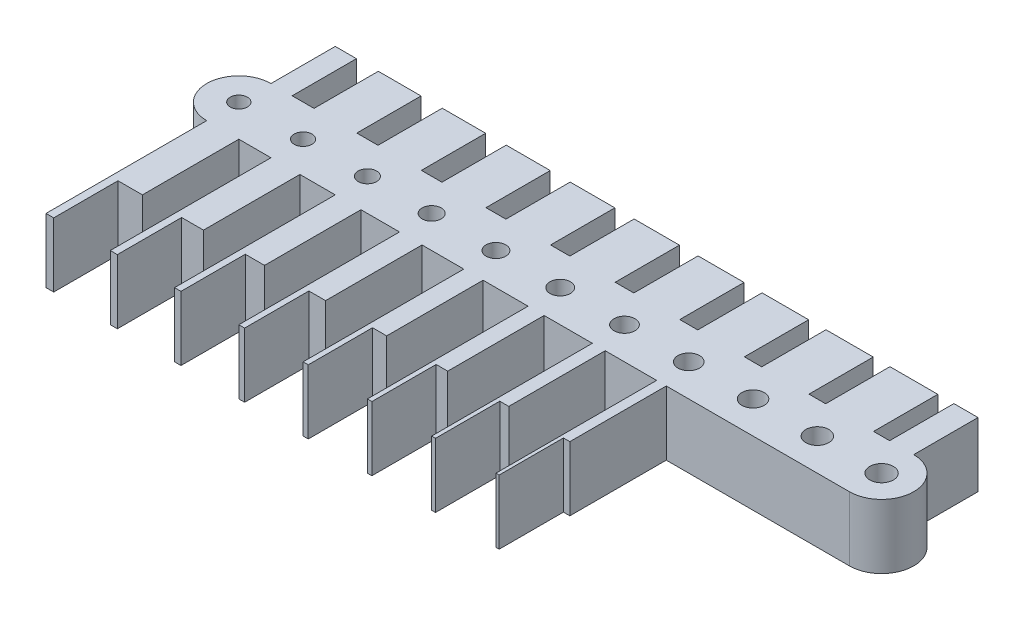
from build123d import *

# Parameters (mm, degrees)
SKETCH1_R              = 1.5875
SKETCH1_R_2            = 1.6375
SKETCH1_R_3            = 1.6875
SKETCH1_R_4            = 1.7375
SKETCH1_R_5            = 1.7875
SKETCH1_R_6            = 1.5375
SKETCH1_R_7            = 1.4875
SKETCH1_R_8            = 1.4375
SKETCH1_R_9            = 1.3875
SKETCH1_R_10           = 1.8375
SKETCH1_R_11           = 1.3375
PIN_DEPTH              = 10
SKETCH2_W              = 5
SKETCH2_H              = 15
SKETCH2_W_2            = 4
SKETCH2_W_3            = 3
SKETCH2_W_4            = 2
SKETCH2_W_5            = 4.5
SKETCH2_W_6            = 3.5
SKETCH2_W_7            = 2.5
SKETCH2_W_8            = 1.5
WIDTH_KEEP_DEPTH       = 10
SKETCH3_W              = 1.2
SKETCH3_H              = 10
SKETCH3_W_2            = 1.1
SKETCH3_W_3            = 1
SKETCH3_W_4            = 0.9
SKETCH3_W_5            = 0.8
SKETCH3_W_6            = 0.7
SKETCH3_W_7            = 0.6
SKETCH3_W_8            = 0.5
WIDTH_DESTROY_DEPTH    = 10
SKETCH4_W              = 3.75
SKETCH4_H              = 10
SKETCH4_W_2            = 3.3
SKETCH4_W_3            = 7.45
SKETCH4_W_4            = 7.35
SKETCH4_W_5            = 7.25
SKETCH4_W_6            = 7.15
SKETCH4_W_7            = 7.05
SKETCH4_W_8            = 6.95
SKETCH4_W_9            = 6.85
SKETCH4_W_10           = 6.75
SKETCH4_W_11           = 6.65
PULLEY_THICKNESS_DEPTH = 10


with BuildPart() as part:
    # Sketch1 → Pin (new body)
    with BuildSketch(Plane(origin=(0, 0, 0), x_dir=(1, 0, 0), z_dir=(0, 1, 0))):
        with BuildLine():
            Line((0, 0), (100, 0))
            ThreePointArc((100, 0), (105, 5), (100, 10))
            Line((100, 10), (0, 10))
            ThreePointArc((0, 10), (-5, 5), (0, 0))
        make_face()
        with Locations(Location((50, 5, 0), (0, 0, 270))):
            Circle(SKETCH1_R, mode=Mode.SUBTRACT)
        with Locations(Location((60, 5, 0), (0, 0, 270))):
            Circle(SKETCH1_R_2, mode=Mode.SUBTRACT)
        with Locations(Location((70, 5, 0), (0, 0, 270))):
            Circle(SKETCH1_R_3, mode=Mode.SUBTRACT)
        with Locations(Location((80, 5, 0), (0, 0, 270))):
            Circle(SKETCH1_R_4, mode=Mode.SUBTRACT)
        with Locations(Location((90, 5, 0), (0, 0, 270))):
            Circle(SKETCH1_R_5, mode=Mode.SUBTRACT)
        with Locations(Location((40, 5, 0), (0, 0, 270))):
            Circle(SKETCH1_R_6, mode=Mode.SUBTRACT)
        with Locations(Location((30, 5, 0), (0, 0, 270))):
            Circle(SKETCH1_R_7, mode=Mode.SUBTRACT)
        with Locations(Location((20, 5, 0), (0, 0, 270))):
            Circle(SKETCH1_R_8, mode=Mode.SUBTRACT)
        with Locations(Location((10, 5, 0), (0, 0, 270))):
            Circle(SKETCH1_R_9, mode=Mode.SUBTRACT)
        with Locations(Location((100, 5, 0), (0, 0, 270))):
            Circle(SKETCH1_R_10, mode=Mode.SUBTRACT)
        with Locations(Location((0, 5, 0), (0, 0, 270))):
            Circle(SKETCH1_R_11, mode=Mode.SUBTRACT)
    extrude(amount=PIN_DEPTH)

    # Sketch2 → Width Keep (add)
    with BuildSketch(Plane(origin=(0, 10, 0), x_dir=(1, 0, 0), z_dir=(0, 1, 0))):
        with Locations((2.5, -7.5)):
            Rectangle(SKETCH2_W, SKETCH2_H)
        with Locations((22, -7.5)):
            Rectangle(SKETCH2_W_2, SKETCH2_H)
        with Locations((41.5, -7.5)):
            Rectangle(SKETCH2_W_3, SKETCH2_H)
        with Locations((61, -7.5)):
            Rectangle(SKETCH2_W_4, SKETCH2_H)
        with Locations((12.25, -7.5)):
            Rectangle(SKETCH2_W_5, SKETCH2_H)
        with Locations((31.75, -7.5)):
            Rectangle(SKETCH2_W_6, SKETCH2_H)
        with Locations((51.25, -7.5)):
            Rectangle(SKETCH2_W_7, SKETCH2_H)
        with Locations((70.75, -7.5)):
            Rectangle(SKETCH2_W_8, SKETCH2_H)
    extrude(amount=-WIDTH_KEEP_DEPTH)

    # Sketch3 → Width Destroy (add)
    with BuildSketch(Plane(origin=(0, 10, 0), x_dir=(1, 0, 0), z_dir=(0, 1, 0))):
        with Locations((0.6, -20)):
            Rectangle(SKETCH3_W, SKETCH3_H)
        with Locations((10.55, -20)):
            Rectangle(SKETCH3_W_2, SKETCH3_H)
        with Locations((20.5, -20)):
            Rectangle(SKETCH3_W_3, SKETCH3_H)
        with Locations((30.45, -20)):
            Rectangle(SKETCH3_W_4, SKETCH3_H)
        with Locations((40.4, -20)):
            Rectangle(SKETCH3_W_5, SKETCH3_H)
        with Locations((50.35, -20)):
            Rectangle(SKETCH3_W_6, SKETCH3_H)
        with Locations((60.3, -20)):
            Rectangle(SKETCH3_W_7, SKETCH3_H)
        with Locations((70.25, -20)):
            Rectangle(SKETCH3_W_8, SKETCH3_H)
    extrude(amount=-WIDTH_DESTROY_DEPTH)

    # Sketch4 → Pulley Thickness (add)
    with BuildSketch(Plane(origin=(0, 10, 0), x_dir=(1, 0, 0), z_dir=(0, 1, 0))):
        with Locations((98.125, 15)):
            Rectangle(SKETCH4_W, SKETCH4_H)
        with Locations((1.65, 15)):
            Rectangle(SKETCH4_W_2, SKETCH4_H)
        with Locations((90.025, 15)):
            Rectangle(SKETCH4_W_3, SKETCH4_H)
        with Locations((80.025, 15)):
            Rectangle(SKETCH4_W_4, SKETCH4_H)
        with Locations((70.025, 15)):
            Rectangle(SKETCH4_W_5, SKETCH4_H)
        with Locations((60.025, 15)):
            Rectangle(SKETCH4_W_6, SKETCH4_H)
        with Locations((50.025, 15)):
            Rectangle(SKETCH4_W_7, SKETCH4_H)
        with Locations((40.025, 15)):
            Rectangle(SKETCH4_W_8, SKETCH4_H)
        with Locations((30.025, 15)):
            Rectangle(SKETCH4_W_9, SKETCH4_H)
        with Locations((20.025, 15)):
            Rectangle(SKETCH4_W_10, SKETCH4_H)
        with Locations((10.025, 15)):
            Rectangle(SKETCH4_W_11, SKETCH4_H)
    extrude(amount=-PULLEY_THICKNESS_DEPTH)


solid = part.part
